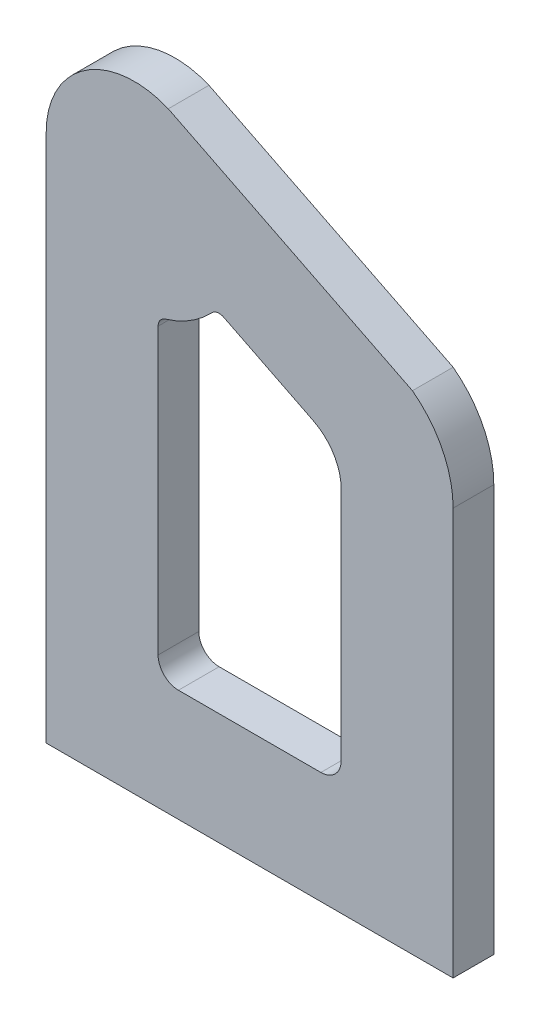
ISO-10303-21;
HEADER;
FILE_DESCRIPTION(('STEP AP214'),'2;1');
FILE_NAME('part.step','',(''),(''),'','','');
FILE_SCHEMA(('AUTOMOTIVE_DESIGN { 1 0 10303 214 1 1 1 1 }'));
ENDSEC;
DATA;
#1=APPLICATION_CONTEXT('core data for automotive mechanical design processes');
#2=APPLICATION_PROTOCOL_DEFINITION('international standard','automotive_design',2000,#1);
#3=PRODUCT_CONTEXT('',#1,'mechanical');
#4=PRODUCT('Part','Part','',(#3));
#5=PRODUCT_RELATED_PRODUCT_CATEGORY('part','',(#4));
#6=PRODUCT_DEFINITION_FORMATION('','',#4);
#7=PRODUCT_DEFINITION_CONTEXT('part definition',#1,'design');
#8=PRODUCT_DEFINITION('design','',#6,#7);
#9=PRODUCT_DEFINITION_SHAPE('','',#8);
#10=(LENGTH_UNIT() NAMED_UNIT(*) SI_UNIT(.MILLI.,.METRE.));
#11=(NAMED_UNIT(*) PLANE_ANGLE_UNIT() SI_UNIT($,.RADIAN.));
#12=(NAMED_UNIT(*) SI_UNIT($,.STERADIAN.) SOLID_ANGLE_UNIT());
#13=UNCERTAINTY_MEASURE_WITH_UNIT(LENGTH_MEASURE(1.E-05),#10,'distance_accuracy_value','');
#14=(GEOMETRIC_REPRESENTATION_CONTEXT(3) GLOBAL_UNCERTAINTY_ASSIGNED_CONTEXT((#13)) GLOBAL_UNIT_ASSIGNED_CONTEXT((#10,
#11,#12)) REPRESENTATION_CONTEXT('',''));
#15=CARTESIAN_POINT('',(0.,0.,0.));
#16=DIRECTION('',(0.,0.,1.));
#17=DIRECTION('',(1.,0.,0.));
#18=AXIS2_PLACEMENT_3D('',#15,#16,#17);
#19=CARTESIAN_POINT('',(-46.6666666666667,160.,20.));
#20=DIRECTION('',(0.,0.,-1.));
#21=DIRECTION('',(-1.,0.,0.));
#22=AXIS2_PLACEMENT_3D('',#19,#20,#21);
#23=PLANE('',#22);
#24=DIRECTION('',(0.,1.,0.));
#25=VECTOR('',#24,1.);
#26=CARTESIAN_POINT('',(-90.,-100.,20.));
#27=LINE('',#26,#25);
#28=CARTESIAN_POINT('',(-90.,-100.,20.));
#29=VERTEX_POINT('',#28);
#30=CARTESIAN_POINT('',(-90.,160.,20.));
#31=VERTEX_POINT('',#30);
#32=EDGE_CURVE('E239',#29,#31,#27,.T.);
#33=ORIENTED_EDGE('',*,*,#32,.F.);
#34=DIRECTION('',(1.,0.,0.));
#35=VECTOR('',#34,1.);
#36=CARTESIAN_POINT('',(-90.,-100.,20.));
#37=LINE('',#36,#35);
#38=CARTESIAN_POINT('',(110.,-100.,20.));
#39=VERTEX_POINT('',#38);
#40=EDGE_CURVE('E251',#29,#39,#37,.T.);
#41=ORIENTED_EDGE('',*,*,#40,.T.);
#42=DIRECTION('',(0.,1.,0.));
#43=VECTOR('',#42,1.);
#44=CARTESIAN_POINT('',(110.,-100.,20.));
#45=LINE('',#44,#43);
#46=CARTESIAN_POINT('',(110.,100.,20.));
#47=VERTEX_POINT('',#46);
#48=EDGE_CURVE('E253',#39,#47,#45,.T.);
#49=ORIENTED_EDGE('',*,*,#48,.T.);
#50=CARTESIAN_POINT('',(60.,100.,20.));
#51=DIRECTION('',(0.,0.,1.));
#52=DIRECTION('',(1.,0.,0.));
#53=AXIS2_PLACEMENT_3D('',#50,#51,#52);
#54=CIRCLE('',#53,50.);
#55=CARTESIAN_POINT('',(90.,140.,20.));
#56=VERTEX_POINT('',#55);
#57=EDGE_CURVE('E248',#47,#56,#54,.T.);
#58=ORIENTED_EDGE('',*,*,#57,.T.);
#59=DIRECTION('',(0.894427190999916,-0.447213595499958,0.));
#60=VECTOR('',#59,1.);
#61=CARTESIAN_POINT('',(-30.,200.,20.));
#62=LINE('',#61,#60);
#63=CARTESIAN_POINT('',(-30.,200.,20.));
#64=VERTEX_POINT('',#63);
#65=EDGE_CURVE('E249',#64,#56,#62,.T.);
#66=ORIENTED_EDGE('',*,*,#65,.F.);
#67=CARTESIAN_POINT('',(-46.6666666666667,160.,20.));
#68=DIRECTION('',(0.,0.,-1.));
#69=DIRECTION('',(-1.,0.,0.));
#70=AXIS2_PLACEMENT_3D('',#67,#68,#69);
#71=CIRCLE('',#70,43.3333333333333);
#72=EDGE_CURVE('E241',#31,#64,#71,.T.);
#73=ORIENTED_EDGE('',*,*,#72,.F.);
#74=EDGE_LOOP('',(#33,#41,#49,#58,#66,#73));
#75=FACE_BOUND('',#74,.T.);
#76=CARTESIAN_POINT('',(45.,-35.,20.));
#77=DIRECTION('',(0.,0.,1.));
#78=DIRECTION('',(1.,0.,0.));
#79=AXIS2_PLACEMENT_3D('',#76,#77,#78);
#80=CIRCLE('',#79,10.);
#81=CARTESIAN_POINT('',(45.,-45.,20.));
#82=VERTEX_POINT('',#81);
#83=CARTESIAN_POINT('',(55.,-34.9999999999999,20.));
#84=VERTEX_POINT('',#83);
#85=EDGE_CURVE('E156',#82,#84,#80,.T.);
#86=ORIENTED_EDGE('',*,*,#85,.F.);
#87=DIRECTION('',(-1.,0.,0.));
#88=VECTOR('',#87,1.);
#89=CARTESIAN_POINT('',(45.,-45.,20.));
#90=LINE('',#89,#88);
#91=CARTESIAN_POINT('',(-24.9999999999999,-45.,20.));
#92=VERTEX_POINT('',#91);
#93=EDGE_CURVE('E196',#82,#92,#90,.T.);
#94=ORIENTED_EDGE('',*,*,#93,.T.);
#95=CARTESIAN_POINT('',(-25.,-35.,20.));
#96=DIRECTION('',(0.,0.,1.));
#97=DIRECTION('',(1.,0.,0.));
#98=AXIS2_PLACEMENT_3D('',#95,#96,#97);
#99=CIRCLE('',#98,10.);
#100=CARTESIAN_POINT('',(-35.,-34.9999999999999,20.));
#101=VERTEX_POINT('',#100);
#102=EDGE_CURVE('E192',#101,#92,#99,.T.);
#103=ORIENTED_EDGE('',*,*,#102,.F.);
#104=DIRECTION('',(0.,1.,0.));
#105=VECTOR('',#104,1.);
#106=CARTESIAN_POINT('',(-35.,-34.9999999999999,20.));
#107=LINE('',#106,#105);
#108=CARTESIAN_POINT('',(-35.,104.968443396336,20.));
#109=VERTEX_POINT('',#108);
#110=EDGE_CURVE('E191',#101,#109,#107,.T.);
#111=ORIENTED_EDGE('',*,*,#110,.T.);
#112=CARTESIAN_POINT('',(-30.,104.968443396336,20.));
#113=DIRECTION('',(0.,0.,-1.));
#114=DIRECTION('',(-1.,0.,0.));
#115=AXIS2_PLACEMENT_3D('',#112,#113,#114);
#116=CIRCLE('',#115,5.);
#117=CARTESIAN_POINT('',(-31.4492753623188,109.753796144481,20.));
#118=VERTEX_POINT('',#117);
#119=EDGE_CURVE('E188',#109,#118,#116,.T.);
#120=ORIENTED_EDGE('',*,*,#119,.T.);
#121=CARTESIAN_POINT('',(-46.6666666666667,160.,20.));
#122=DIRECTION('',(0.,0.,-1.));
#123=DIRECTION('',(-1.,0.,0.));
#124=AXIS2_PLACEMENT_3D('',#121,#122,#123);
#125=CIRCLE('',#124,52.5);
#126=CARTESIAN_POINT('',(-8.59793172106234,123.847248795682,20.));
#127=VERTEX_POINT('',#126);
#128=EDGE_CURVE('E186',#127,#118,#125,.T.);
#129=ORIENTED_EDGE('',*,*,#128,.F.);
#130=CARTESIAN_POINT('',(-4.97233791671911,120.404129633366,20.));
#131=DIRECTION('',(0.,0.,1.));
#132=DIRECTION('',(1.,0.,0.));
#133=AXIS2_PLACEMENT_3D('',#130,#131,#132);
#134=CIRCLE('',#133,4.99999999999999);
#135=CARTESIAN_POINT('',(-2.73626993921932,124.876265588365,20.));
#136=VERTEX_POINT('',#135);
#137=EDGE_CURVE('E183',#136,#127,#134,.T.);
#138=ORIENTED_EDGE('',*,*,#137,.F.);
#139=DIRECTION('',(0.894427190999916,-0.447213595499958,0.));
#140=VECTOR('',#139,1.);
#141=CARTESIAN_POINT('',(-2.73626993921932,124.876265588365,20.));
#142=LINE('',#141,#140);
#143=CARTESIAN_POINT('',(41.1803398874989,102.917960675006,20.));
#144=VERTEX_POINT('',#143);
#145=EDGE_CURVE('E182',#136,#144,#142,.T.);
#146=ORIENTED_EDGE('',*,*,#145,.T.);
#147=CARTESIAN_POINT('',(30.,80.5572809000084,20.));
#148=DIRECTION('',(0.,0.,-1.));
#149=DIRECTION('',(-1.,0.,0.));
#150=AXIS2_PLACEMENT_3D('',#147,#148,#149);
#151=CIRCLE('',#150,25.);
#152=CARTESIAN_POINT('',(55.,80.5572809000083,20.));
#153=VERTEX_POINT('',#152);
#154=EDGE_CURVE('E177',#144,#153,#151,.T.);
#155=ORIENTED_EDGE('',*,*,#154,.T.);
#156=DIRECTION('',(0.,-1.,0.));
#157=VECTOR('',#156,1.);
#158=CARTESIAN_POINT('',(55.,80.5572809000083,20.));
#159=LINE('',#158,#157);
#160=EDGE_CURVE('E164',#153,#84,#159,.T.);
#161=ORIENTED_EDGE('',*,*,#160,.T.);
#162=EDGE_LOOP('',(#86,#94,#103,#111,#120,#129,#138,#146,#155,#161));
#163=FACE_BOUND('',#162,.T.);
#164=ADVANCED_FACE('F43',(#75,#163),#23,.F.);
#165=CARTESIAN_POINT('',(-46.6666666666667,160.,0.));
#166=DIRECTION('',(0.,0.,-1.));
#167=DIRECTION('',(-1.,0.,0.));
#168=AXIS2_PLACEMENT_3D('',#165,#166,#167);
#169=PLANE('',#168);
#170=DIRECTION('',(0.,1.,0.));
#171=VECTOR('',#170,1.);
#172=CARTESIAN_POINT('',(-90.,-100.,0.));
#173=LINE('',#172,#171);
#174=CARTESIAN_POINT('',(-90.,-100.,0.));
#175=VERTEX_POINT('',#174);
#176=CARTESIAN_POINT('',(-90.,160.,0.));
#177=VERTEX_POINT('',#176);
#178=EDGE_CURVE('E173',#175,#177,#173,.T.);
#179=ORIENTED_EDGE('',*,*,#178,.T.);
#180=CARTESIAN_POINT('',(-46.6666666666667,160.,0.));
#181=DIRECTION('',(0.,0.,-1.));
#182=DIRECTION('',(-1.,0.,0.));
#183=AXIS2_PLACEMENT_3D('',#180,#181,#182);
#184=CIRCLE('',#183,43.3333333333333);
#185=CARTESIAN_POINT('',(-30.,200.,0.));
#186=VERTEX_POINT('',#185);
#187=EDGE_CURVE('E260',#177,#186,#184,.T.);
#188=ORIENTED_EDGE('',*,*,#187,.T.);
#189=DIRECTION('',(0.894427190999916,-0.447213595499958,0.));
#190=VECTOR('',#189,1.);
#191=CARTESIAN_POINT('',(-30.,200.,0.));
#192=LINE('',#191,#190);
#193=CARTESIAN_POINT('',(90.,140.,0.));
#194=VERTEX_POINT('',#193);
#195=EDGE_CURVE('E257',#186,#194,#192,.T.);
#196=ORIENTED_EDGE('',*,*,#195,.T.);
#197=CARTESIAN_POINT('',(60.,100.,0.));
#198=DIRECTION('',(0.,0.,1.));
#199=DIRECTION('',(1.,0.,0.));
#200=AXIS2_PLACEMENT_3D('',#197,#198,#199);
#201=CIRCLE('',#200,50.);
#202=CARTESIAN_POINT('',(110.,100.,0.));
#203=VERTEX_POINT('',#202);
#204=EDGE_CURVE('E263',#203,#194,#201,.T.);
#205=ORIENTED_EDGE('',*,*,#204,.F.);
#206=DIRECTION('',(0.,1.,0.));
#207=VECTOR('',#206,1.);
#208=CARTESIAN_POINT('',(110.,-100.,0.));
#209=LINE('',#208,#207);
#210=CARTESIAN_POINT('',(110.,-100.,0.));
#211=VERTEX_POINT('',#210);
#212=EDGE_CURVE('E266',#211,#203,#209,.T.);
#213=ORIENTED_EDGE('',*,*,#212,.F.);
#214=DIRECTION('',(1.,0.,0.));
#215=VECTOR('',#214,1.);
#216=CARTESIAN_POINT('',(-90.,-100.,0.));
#217=LINE('',#216,#215);
#218=EDGE_CURVE('E245',#175,#211,#217,.T.);
#219=ORIENTED_EDGE('',*,*,#218,.F.);
#220=EDGE_LOOP('',(#179,#188,#196,#205,#213,#219));
#221=FACE_BOUND('',#220,.T.);
#222=DIRECTION('',(-1.,0.,0.));
#223=VECTOR('',#222,1.);
#224=CARTESIAN_POINT('',(45.,-45.,0.));
#225=LINE('',#224,#223);
#226=CARTESIAN_POINT('',(45.,-45.,0.));
#227=VERTEX_POINT('',#226);
#228=CARTESIAN_POINT('',(-24.9999999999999,-45.,0.));
#229=VERTEX_POINT('',#228);
#230=EDGE_CURVE('E167',#227,#229,#225,.T.);
#231=ORIENTED_EDGE('',*,*,#230,.F.);
#232=CARTESIAN_POINT('',(45.,-35.,0.));
#233=DIRECTION('',(0.,0.,1.));
#234=DIRECTION('',(1.,0.,0.));
#235=AXIS2_PLACEMENT_3D('',#232,#233,#234);
#236=CIRCLE('',#235,10.);
#237=CARTESIAN_POINT('',(55.,-34.9999999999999,0.));
#238=VERTEX_POINT('',#237);
#239=EDGE_CURVE('E68',#227,#238,#236,.T.);
#240=ORIENTED_EDGE('',*,*,#239,.T.);
#241=DIRECTION('',(0.,-1.,0.));
#242=VECTOR('',#241,1.);
#243=CARTESIAN_POINT('',(55.,80.5572809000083,0.));
#244=LINE('',#243,#242);
#245=CARTESIAN_POINT('',(55.,80.5572809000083,0.));
#246=VERTEX_POINT('',#245);
#247=EDGE_CURVE('E172',#246,#238,#244,.T.);
#248=ORIENTED_EDGE('',*,*,#247,.F.);
#249=CARTESIAN_POINT('',(30.,80.5572809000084,0.));
#250=DIRECTION('',(0.,0.,-1.));
#251=DIRECTION('',(-1.,0.,0.));
#252=AXIS2_PLACEMENT_3D('',#249,#250,#251);
#253=CIRCLE('',#252,25.);
#254=CARTESIAN_POINT('',(41.1803398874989,102.917960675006,0.));
#255=VERTEX_POINT('',#254);
#256=EDGE_CURVE('E205',#255,#246,#253,.T.);
#257=ORIENTED_EDGE('',*,*,#256,.F.);
#258=DIRECTION('',(0.894427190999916,-0.447213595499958,0.));
#259=VECTOR('',#258,1.);
#260=CARTESIAN_POINT('',(-2.73626993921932,124.876265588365,0.));
#261=LINE('',#260,#259);
#262=CARTESIAN_POINT('',(-2.73626993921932,124.876265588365,0.));
#263=VERTEX_POINT('',#262);
#264=EDGE_CURVE('E202',#263,#255,#261,.T.);
#265=ORIENTED_EDGE('',*,*,#264,.F.);
#266=CARTESIAN_POINT('',(-4.97233791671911,120.404129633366,0.));
#267=DIRECTION('',(0.,0.,1.));
#268=DIRECTION('',(1.,0.,0.));
#269=AXIS2_PLACEMENT_3D('',#266,#267,#268);
#270=CIRCLE('',#269,4.99999999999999);
#271=CARTESIAN_POINT('',(-8.59793172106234,123.847248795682,0.));
#272=VERTEX_POINT('',#271);
#273=EDGE_CURVE('E208',#263,#272,#270,.T.);
#274=ORIENTED_EDGE('',*,*,#273,.T.);
#275=CARTESIAN_POINT('',(-46.6666666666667,160.,0.));
#276=DIRECTION('',(0.,0.,-1.));
#277=DIRECTION('',(-1.,0.,0.));
#278=AXIS2_PLACEMENT_3D('',#275,#276,#277);
#279=CIRCLE('',#278,52.5);
#280=CARTESIAN_POINT('',(-31.4492753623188,109.753796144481,0.));
#281=VERTEX_POINT('',#280);
#282=EDGE_CURVE('E211',#272,#281,#279,.T.);
#283=ORIENTED_EDGE('',*,*,#282,.T.);
#284=CARTESIAN_POINT('',(-30.,104.968443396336,0.));
#285=DIRECTION('',(0.,0.,-1.));
#286=DIRECTION('',(-1.,0.,0.));
#287=AXIS2_PLACEMENT_3D('',#284,#285,#286);
#288=CIRCLE('',#287,5.);
#289=CARTESIAN_POINT('',(-35.,104.968443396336,0.));
#290=VERTEX_POINT('',#289);
#291=EDGE_CURVE('E212',#290,#281,#288,.T.);
#292=ORIENTED_EDGE('',*,*,#291,.F.);
#293=DIRECTION('',(0.,1.,0.));
#294=VECTOR('',#293,1.);
#295=CARTESIAN_POINT('',(-35.,-34.9999999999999,0.));
#296=LINE('',#295,#294);
#297=CARTESIAN_POINT('',(-35.,-34.9999999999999,0.));
#298=VERTEX_POINT('',#297);
#299=EDGE_CURVE('E220',#298,#290,#296,.T.);
#300=ORIENTED_EDGE('',*,*,#299,.F.);
#301=CARTESIAN_POINT('',(-25.,-35.,0.));
#302=DIRECTION('',(0.,0.,1.));
#303=DIRECTION('',(1.,0.,0.));
#304=AXIS2_PLACEMENT_3D('',#301,#302,#303);
#305=CIRCLE('',#304,10.);
#306=EDGE_CURVE('E219',#298,#229,#305,.T.);
#307=ORIENTED_EDGE('',*,*,#306,.T.);
#308=EDGE_LOOP('',(#231,#240,#248,#257,#265,#274,#283,#292,#300,#307));
#309=FACE_BOUND('',#308,.T.);
#310=ADVANCED_FACE('F286',(#221,#309),#169,.T.);
#311=CARTESIAN_POINT('',(-90.,-100.,20.));
#312=DIRECTION('',(-1.,0.,0.));
#313=DIRECTION('',(0.,0.,1.));
#314=AXIS2_PLACEMENT_3D('',#311,#312,#313);
#315=PLANE('',#314);
#316=ORIENTED_EDGE('',*,*,#178,.F.);
#317=DIRECTION('',(0.,0.,-1.));
#318=VECTOR('',#317,1.);
#319=CARTESIAN_POINT('',(-90.,-100.,20.));
#320=LINE('',#319,#318);
#321=EDGE_CURVE('E11',#29,#175,#320,.T.);
#322=ORIENTED_EDGE('',*,*,#321,.F.);
#323=ORIENTED_EDGE('',*,*,#32,.T.);
#324=DIRECTION('',(0.,0.,-1.));
#325=VECTOR('',#324,1.);
#326=CARTESIAN_POINT('',(-90.,160.,20.));
#327=LINE('',#326,#325);
#328=EDGE_CURVE('E50',#31,#177,#327,.T.);
#329=ORIENTED_EDGE('',*,*,#328,.T.);
#330=EDGE_LOOP('',(#316,#322,#323,#329));
#331=FACE_BOUND('',#330,.T.);
#332=ADVANCED_FACE('F44',(#331),#315,.T.);
#333=CARTESIAN_POINT('',(-90.,-100.,20.));
#334=DIRECTION('',(0.,1.,0.));
#335=DIRECTION('',(0.,0.,1.));
#336=AXIS2_PLACEMENT_3D('',#333,#334,#335);
#337=PLANE('',#336);
#338=ORIENTED_EDGE('',*,*,#218,.T.);
#339=DIRECTION('',(0.,0.,-1.));
#340=VECTOR('',#339,1.);
#341=CARTESIAN_POINT('',(110.,-100.,20.));
#342=LINE('',#341,#340);
#343=EDGE_CURVE('E55',#39,#211,#342,.T.);
#344=ORIENTED_EDGE('',*,*,#343,.F.);
#345=ORIENTED_EDGE('',*,*,#40,.F.);
#346=ORIENTED_EDGE('',*,*,#321,.T.);
#347=EDGE_LOOP('',(#338,#344,#345,#346));
#348=FACE_BOUND('',#347,.T.);
#349=ADVANCED_FACE('F295',(#348),#337,.F.);
#350=CARTESIAN_POINT('',(110.,-100.,20.));
#351=DIRECTION('',(-1.,0.,0.));
#352=DIRECTION('',(0.,0.,1.));
#353=AXIS2_PLACEMENT_3D('',#350,#351,#352);
#354=PLANE('',#353);
#355=ORIENTED_EDGE('',*,*,#212,.T.);
#356=DIRECTION('',(0.,0.,-1.));
#357=VECTOR('',#356,1.);
#358=CARTESIAN_POINT('',(110.,100.,20.));
#359=LINE('',#358,#357);
#360=EDGE_CURVE('E271',#47,#203,#359,.T.);
#361=ORIENTED_EDGE('',*,*,#360,.F.);
#362=ORIENTED_EDGE('',*,*,#48,.F.);
#363=ORIENTED_EDGE('',*,*,#343,.T.);
#364=EDGE_LOOP('',(#355,#361,#362,#363));
#365=FACE_BOUND('',#364,.T.);
#366=ADVANCED_FACE('F299',(#365),#354,.F.);
#367=CARTESIAN_POINT('',(60.,100.,20.));
#368=DIRECTION('',(0.,0.,-1.));
#369=DIRECTION('',(-1.,0.,0.));
#370=AXIS2_PLACEMENT_3D('',#367,#368,#369);
#371=CYLINDRICAL_SURFACE('',#370,50.);
#372=ORIENTED_EDGE('',*,*,#204,.T.);
#373=DIRECTION('',(0.,0.,-1.));
#374=VECTOR('',#373,1.);
#375=CARTESIAN_POINT('',(90.,140.,20.));
#376=LINE('',#375,#374);
#377=EDGE_CURVE('E273',#56,#194,#376,.T.);
#378=ORIENTED_EDGE('',*,*,#377,.F.);
#379=ORIENTED_EDGE('',*,*,#57,.F.);
#380=ORIENTED_EDGE('',*,*,#360,.T.);
#381=EDGE_LOOP('',(#372,#378,#379,#380));
#382=FACE_BOUND('',#381,.T.);
#383=ADVANCED_FACE('F302',(#382),#371,.T.);
#384=CARTESIAN_POINT('',(-30.,200.,20.));
#385=DIRECTION('',(0.447213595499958,0.894427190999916,0.));
#386=DIRECTION('',(-0.894427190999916,0.447213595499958,0.));
#387=AXIS2_PLACEMENT_3D('',#384,#385,#386);
#388=PLANE('',#387);
#389=ORIENTED_EDGE('',*,*,#195,.F.);
#390=DIRECTION('',(0.,0.,-1.));
#391=VECTOR('',#390,1.);
#392=CARTESIAN_POINT('',(-30.,200.,20.));
#393=LINE('',#392,#391);
#394=EDGE_CURVE('E274',#64,#186,#393,.T.);
#395=ORIENTED_EDGE('',*,*,#394,.F.);
#396=ORIENTED_EDGE('',*,*,#65,.T.);
#397=ORIENTED_EDGE('',*,*,#377,.T.);
#398=EDGE_LOOP('',(#389,#395,#396,#397));
#399=FACE_BOUND('',#398,.T.);
#400=ADVANCED_FACE('F305',(#399),#388,.T.);
#401=CARTESIAN_POINT('',(-46.6666666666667,160.,20.));
#402=DIRECTION('',(0.,0.,-1.));
#403=DIRECTION('',(-1.,0.,0.));
#404=AXIS2_PLACEMENT_3D('',#401,#402,#403);
#405=CYLINDRICAL_SURFACE('',#404,43.3333333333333);
#406=ORIENTED_EDGE('',*,*,#187,.F.);
#407=ORIENTED_EDGE('',*,*,#328,.F.);
#408=ORIENTED_EDGE('',*,*,#72,.T.);
#409=ORIENTED_EDGE('',*,*,#394,.T.);
#410=EDGE_LOOP('',(#406,#407,#408,#409));
#411=FACE_BOUND('',#410,.T.);
#412=ADVANCED_FACE('F282',(#411),#405,.T.);
#413=CARTESIAN_POINT('',(45.,-35.,20.));
#414=DIRECTION('',(0.,0.,-1.));
#415=DIRECTION('',(-1.,0.,0.));
#416=AXIS2_PLACEMENT_3D('',#413,#414,#415);
#417=CYLINDRICAL_SURFACE('',#416,10.);
#418=ORIENTED_EDGE('',*,*,#239,.F.);
#419=DIRECTION('',(0.,0.,-1.));
#420=VECTOR('',#419,1.);
#421=CARTESIAN_POINT('',(45.,-45.,20.));
#422=LINE('',#421,#420);
#423=EDGE_CURVE('E161',#82,#227,#422,.T.);
#424=ORIENTED_EDGE('',*,*,#423,.F.);
#425=ORIENTED_EDGE('',*,*,#85,.T.);
#426=DIRECTION('',(0.,0.,-1.));
#427=VECTOR('',#426,1.);
#428=CARTESIAN_POINT('',(55.,-34.9999999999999,20.));
#429=LINE('',#428,#427);
#430=EDGE_CURVE('E157',#84,#238,#429,.T.);
#431=ORIENTED_EDGE('',*,*,#430,.T.);
#432=EDGE_LOOP('',(#418,#424,#425,#431));
#433=FACE_BOUND('',#432,.T.);
#434=ADVANCED_FACE('F158',(#433),#417,.F.);
#435=CARTESIAN_POINT('',(55.,80.5572809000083,20.));
#436=DIRECTION('',(1.,0.,0.));
#437=DIRECTION('',(0.,1.,0.));
#438=AXIS2_PLACEMENT_3D('',#435,#436,#437);
#439=PLANE('',#438);
#440=ORIENTED_EDGE('',*,*,#247,.T.);
#441=ORIENTED_EDGE('',*,*,#430,.F.);
#442=ORIENTED_EDGE('',*,*,#160,.F.);
#443=DIRECTION('',(0.,0.,-1.));
#444=VECTOR('',#443,1.);
#445=CARTESIAN_POINT('',(55.,80.5572809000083,20.));
#446=LINE('',#445,#444);
#447=EDGE_CURVE('E174',#153,#246,#446,.T.);
#448=ORIENTED_EDGE('',*,*,#447,.T.);
#449=EDGE_LOOP('',(#440,#441,#442,#448));
#450=FACE_BOUND('',#449,.T.);
#451=ADVANCED_FACE('F168',(#450),#439,.F.);
#452=CARTESIAN_POINT('',(30.,80.5572809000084,20.));
#453=DIRECTION('',(0.,0.,-1.));
#454=DIRECTION('',(-1.,0.,0.));
#455=AXIS2_PLACEMENT_3D('',#452,#453,#454);
#456=CYLINDRICAL_SURFACE('',#455,25.);
#457=ORIENTED_EDGE('',*,*,#256,.T.);
#458=ORIENTED_EDGE('',*,*,#447,.F.);
#459=ORIENTED_EDGE('',*,*,#154,.F.);
#460=DIRECTION('',(0.,0.,-1.));
#461=VECTOR('',#460,1.);
#462=CARTESIAN_POINT('',(41.1803398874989,102.917960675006,20.));
#463=LINE('',#462,#461);
#464=EDGE_CURVE('E237',#144,#255,#463,.T.);
#465=ORIENTED_EDGE('',*,*,#464,.T.);
#466=EDGE_LOOP('',(#457,#458,#459,#465));
#467=FACE_BOUND('',#466,.T.);
#468=ADVANCED_FACE('F365',(#467),#456,.F.);
#469=CARTESIAN_POINT('',(-2.73626993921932,124.876265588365,20.));
#470=DIRECTION('',(0.447213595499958,0.894427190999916,0.));
#471=DIRECTION('',(-0.894427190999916,0.447213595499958,0.));
#472=AXIS2_PLACEMENT_3D('',#469,#470,#471);
#473=PLANE('',#472);
#474=ORIENTED_EDGE('',*,*,#264,.T.);
#475=ORIENTED_EDGE('',*,*,#464,.F.);
#476=ORIENTED_EDGE('',*,*,#145,.F.);
#477=DIRECTION('',(0.,0.,-1.));
#478=VECTOR('',#477,1.);
#479=CARTESIAN_POINT('',(-2.73626993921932,124.876265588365,20.));
#480=LINE('',#479,#478);
#481=EDGE_CURVE('E232',#136,#263,#480,.T.);
#482=ORIENTED_EDGE('',*,*,#481,.T.);
#483=EDGE_LOOP('',(#474,#475,#476,#482));
#484=FACE_BOUND('',#483,.T.);
#485=ADVANCED_FACE('F367',(#484),#473,.F.);
#486=CARTESIAN_POINT('',(-4.97233791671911,120.404129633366,20.));
#487=DIRECTION('',(0.,0.,-1.));
#488=DIRECTION('',(-1.,0.,0.));
#489=AXIS2_PLACEMENT_3D('',#486,#487,#488);
#490=CYLINDRICAL_SURFACE('',#489,4.99999999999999);
#491=ORIENTED_EDGE('',*,*,#273,.F.);
#492=ORIENTED_EDGE('',*,*,#481,.F.);
#493=ORIENTED_EDGE('',*,*,#137,.T.);
#494=DIRECTION('',(0.,0.,-1.));
#495=VECTOR('',#494,1.);
#496=CARTESIAN_POINT('',(-8.59793172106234,123.847248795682,20.));
#497=LINE('',#496,#495);
#498=EDGE_CURVE('E235',#127,#272,#497,.T.);
#499=ORIENTED_EDGE('',*,*,#498,.T.);
#500=EDGE_LOOP('',(#491,#492,#493,#499));
#501=FACE_BOUND('',#500,.T.);
#502=ADVANCED_FACE('F378',(#501),#490,.F.);
#503=CARTESIAN_POINT('',(-46.6666666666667,160.,20.));
#504=DIRECTION('',(0.,0.,-1.));
#505=DIRECTION('',(-1.,0.,0.));
#506=AXIS2_PLACEMENT_3D('',#503,#504,#505);
#507=CYLINDRICAL_SURFACE('',#506,52.5);
#508=ORIENTED_EDGE('',*,*,#282,.F.);
#509=ORIENTED_EDGE('',*,*,#498,.F.);
#510=ORIENTED_EDGE('',*,*,#128,.T.);
#511=DIRECTION('',(0.,0.,-1.));
#512=VECTOR('',#511,1.);
#513=CARTESIAN_POINT('',(-31.4492753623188,109.753796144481,20.));
#514=LINE('',#513,#512);
#515=EDGE_CURVE('E229',#118,#281,#514,.T.);
#516=ORIENTED_EDGE('',*,*,#515,.T.);
#517=EDGE_LOOP('',(#508,#509,#510,#516));
#518=FACE_BOUND('',#517,.T.);
#519=ADVANCED_FACE('F387',(#518),#507,.T.);
#520=CARTESIAN_POINT('',(-30.,104.968443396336,20.));
#521=DIRECTION('',(0.,0.,-1.));
#522=DIRECTION('',(-1.,0.,0.));
#523=AXIS2_PLACEMENT_3D('',#520,#521,#522);
#524=CYLINDRICAL_SURFACE('',#523,5.);
#525=ORIENTED_EDGE('',*,*,#291,.T.);
#526=ORIENTED_EDGE('',*,*,#515,.F.);
#527=ORIENTED_EDGE('',*,*,#119,.F.);
#528=DIRECTION('',(0.,0.,-1.));
#529=VECTOR('',#528,1.);
#530=CARTESIAN_POINT('',(-35.,104.968443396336,20.));
#531=LINE('',#530,#529);
#532=EDGE_CURVE('E227',#109,#290,#531,.T.);
#533=ORIENTED_EDGE('',*,*,#532,.T.);
#534=EDGE_LOOP('',(#525,#526,#527,#533));
#535=FACE_BOUND('',#534,.T.);
#536=ADVANCED_FACE('F393',(#535),#524,.F.);
#537=CARTESIAN_POINT('',(-35.,-34.9999999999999,20.));
#538=DIRECTION('',(-1.,0.,0.));
#539=DIRECTION('',(0.,-1.,0.));
#540=AXIS2_PLACEMENT_3D('',#537,#538,#539);
#541=PLANE('',#540);
#542=ORIENTED_EDGE('',*,*,#299,.T.);
#543=ORIENTED_EDGE('',*,*,#532,.F.);
#544=ORIENTED_EDGE('',*,*,#110,.F.);
#545=DIRECTION('',(0.,0.,-1.));
#546=VECTOR('',#545,1.);
#547=CARTESIAN_POINT('',(-35.,-34.9999999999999,20.));
#548=LINE('',#547,#546);
#549=EDGE_CURVE('E226',#101,#298,#548,.T.);
#550=ORIENTED_EDGE('',*,*,#549,.T.);
#551=EDGE_LOOP('',(#542,#543,#544,#550));
#552=FACE_BOUND('',#551,.T.);
#553=ADVANCED_FACE('F405',(#552),#541,.F.);
#554=CARTESIAN_POINT('',(-25.,-35.,20.));
#555=DIRECTION('',(0.,0.,-1.));
#556=DIRECTION('',(-1.,0.,0.));
#557=AXIS2_PLACEMENT_3D('',#554,#555,#556);
#558=CYLINDRICAL_SURFACE('',#557,10.);
#559=ORIENTED_EDGE('',*,*,#306,.F.);
#560=ORIENTED_EDGE('',*,*,#549,.F.);
#561=ORIENTED_EDGE('',*,*,#102,.T.);
#562=DIRECTION('',(0.,0.,-1.));
#563=VECTOR('',#562,1.);
#564=CARTESIAN_POINT('',(-24.9999999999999,-45.,20.));
#565=LINE('',#564,#563);
#566=EDGE_CURVE('E58',#92,#229,#565,.T.);
#567=ORIENTED_EDGE('',*,*,#566,.T.);
#568=EDGE_LOOP('',(#559,#560,#561,#567));
#569=FACE_BOUND('',#568,.T.);
#570=ADVANCED_FACE('F407',(#569),#558,.F.);
#571=CARTESIAN_POINT('',(45.,-45.,20.));
#572=DIRECTION('',(0.,-1.,0.));
#573=DIRECTION('',(0.,0.,-1.));
#574=AXIS2_PLACEMENT_3D('',#571,#572,#573);
#575=PLANE('',#574);
#576=ORIENTED_EDGE('',*,*,#230,.T.);
#577=ORIENTED_EDGE('',*,*,#566,.F.);
#578=ORIENTED_EDGE('',*,*,#93,.F.);
#579=ORIENTED_EDGE('',*,*,#423,.T.);
#580=EDGE_LOOP('',(#576,#577,#578,#579));
#581=FACE_BOUND('',#580,.T.);
#582=ADVANCED_FACE('F416',(#581),#575,.F.);
#583=CLOSED_SHELL('',(#164,#310,#332,#349,#366,#383,#400,#412,#434,#451,#468,#485,#502,#519,
#536,#553,#570,#582));
#584=MANIFOLD_SOLID_BREP('B2',#583);
#585=ADVANCED_BREP_SHAPE_REPRESENTATION('',(#18,#584),#14);
#586=SHAPE_DEFINITION_REPRESENTATION(#9,#585);
ENDSEC;
END-ISO-10303-21;
